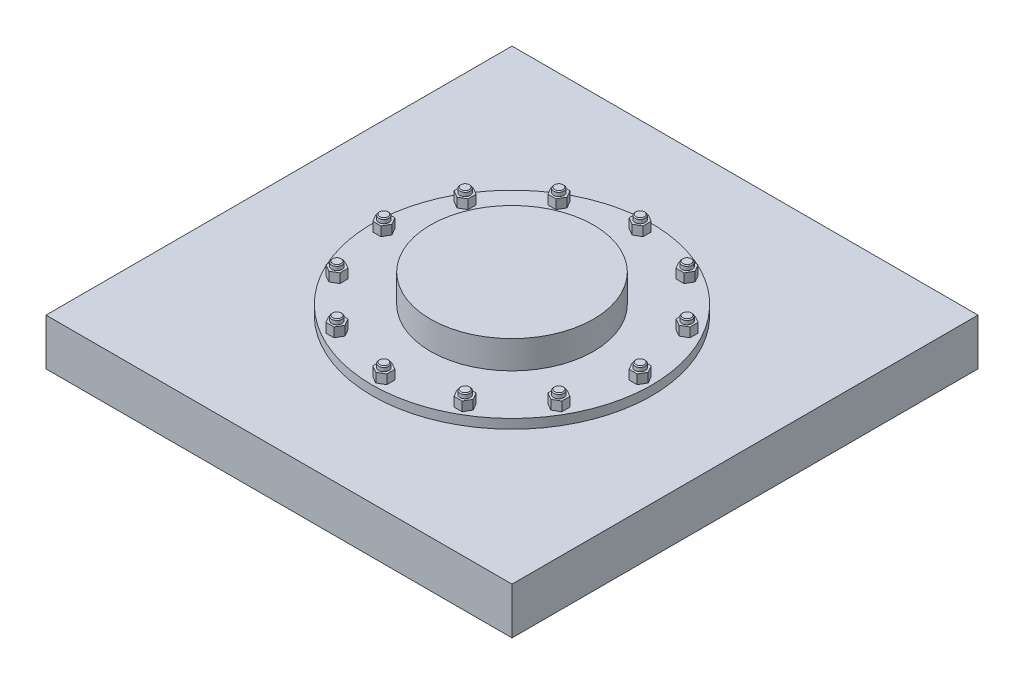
from build123d import *

# Parameters (mm, degrees)
SKETCH1_W                    = 1000
SKETCH1_H                    = 1000
EXTRUDE1_DEPTH               = 100
SKETCH2_R                    = 300
EXTRUDE2_DEPTH               = 20
SKETCH3_R                    = 175
EXTRUDE3_DEPTH               = 60
SKETCH4_R                    = 11
EXTRUDE4_DEPTH               = 30
CHAMFER1_SIZE                = 2
EXTRUDE5_DEPTH               = 20
CIRPATTERN3_COUNT            = 12
CHAMFER1_OF_CIRPATTERN3_SIZE = 2


with BuildPart() as part:
    # Sketch1 → Extrude1 (new body)
    with BuildSketch(Plane(origin=(0, 0, 0), x_dir=(1, 0, 0), z_dir=(0, 1, 0))):
        Rectangle(SKETCH1_W, SKETCH1_H)
    extrude(amount=EXTRUDE1_DEPTH)

    # Sketch2 → Extrude2 (add)
    with BuildSketch(Plane(origin=(0, 100, 0), x_dir=(1, 0, 0), z_dir=(0, 1, 0))):
        with Locations(Location((0, 0, 0), (0, 0, 270))):
            Circle(SKETCH2_R)
    extrude(amount=EXTRUDE2_DEPTH)

    # Sketch3 → Extrude3 (add)
    with BuildSketch(Plane(origin=(0, 120, 0), x_dir=(1, 0, 0), z_dir=(0, 1, 0))):
        with Locations(Location((0, 0, 0), (0, 0, 270))):
            Circle(SKETCH3_R)
    extrude(amount=EXTRUDE3_DEPTH)

    # Sketch4 → Extrude4 (add)
    with BuildSketch(Plane(origin=(0, 120, 0), x_dir=(1, 0, 0), z_dir=(0, 1, 0))):
        with Locations(Location((275, 0, 0), (0, 0, 270))):
            Circle(SKETCH4_R)
    extrude4 = extrude(amount=EXTRUDE4_DEPTH)

    # Chamfer1
    chamfer1_edges = [part.edges().sort_by_distance(p)[0] for p in [
        (275, 150, -11),
    ]]
    chamfer(chamfer1_edges, length=CHAMFER1_SIZE)

    # Sketch5 → Extrude5 (add)
    with BuildSketch(Plane(origin=(0, 120, 0), x_dir=(1, 0, 0), z_dir=(0, 1, 0))):
        Polygon((292.320508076, 0), (283.660254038, 15), (266.339745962, 15), (257.679491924, 0), (266.339745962, -15), (283.660254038, -15), align=None)
    extrude5 = extrude(amount=EXTRUDE5_DEPTH)

    # CirPattern3: Extrude4, Extrude5 ×12 about axis
    cirpattern3_axis = Axis((0, 0, 0), (0, 1, 0))
    add([extrude4.rotate(cirpattern3_axis, i * 360 / CIRPATTERN3_COUNT) for i in range(1, CIRPATTERN3_COUNT)])
    add([extrude5.rotate(cirpattern3_axis, i * 360 / CIRPATTERN3_COUNT) for i in range(1, CIRPATTERN3_COUNT)])

    # Chamfer1 of CirPattern3
    chamfer1_of_cirpattern3_edges = [part.edges().sort_by_distance(p)[0] for p in [
        (232.656986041, 150, -147.026279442),
        (127.973720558, 150, -243.656986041),
        (-11, 150, -275),
        (-147.026279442, 150, -232.656986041),
        (-243.656986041, 150, -127.973720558),
        (-275, 150, 11),
        (-232.656986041, 150, 147.026279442),
        (-127.973720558, 150, 243.656986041),
        (11, 150, 275),
        (147.026279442, 150, 232.656986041),
        (243.656986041, 150, 127.973720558),
    ]]
    chamfer(chamfer1_of_cirpattern3_edges, length=CHAMFER1_OF_CIRPATTERN3_SIZE)


solid = part.part
